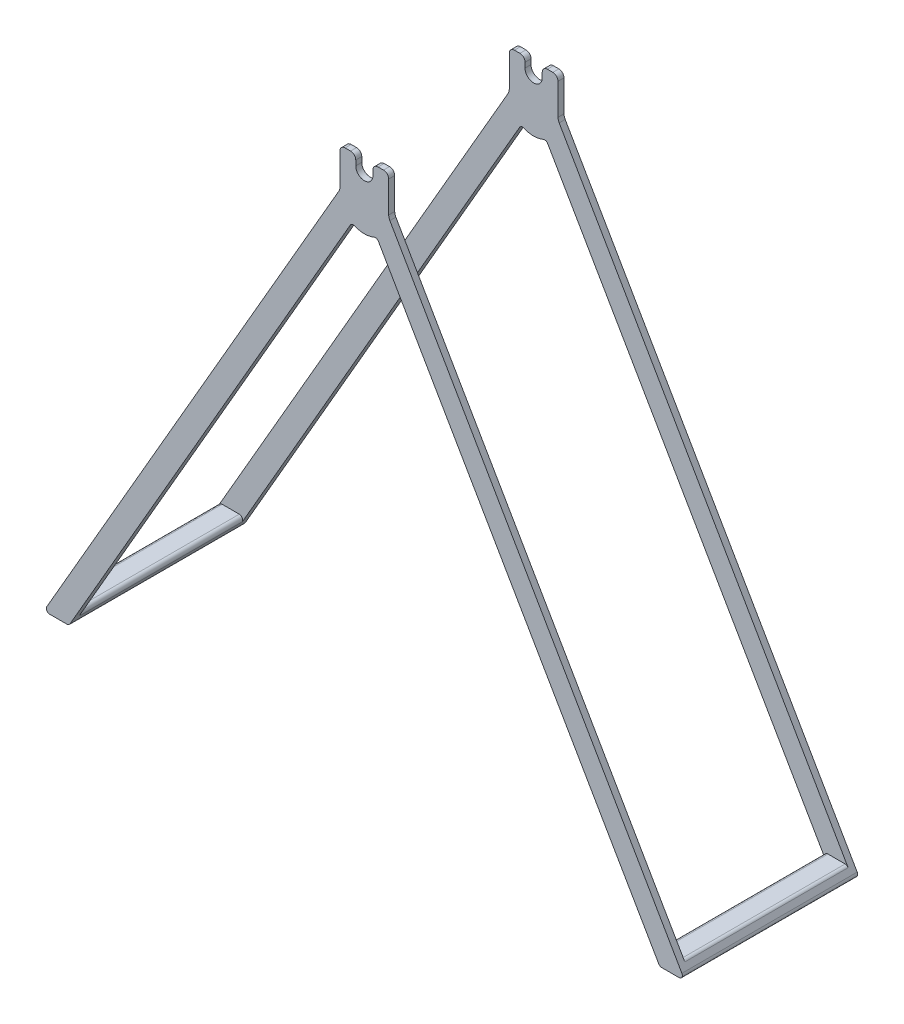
from build123d import *

# Parameters (mm, degrees)
ESTRUSIONE_ESTRUSIONE1_DEPTH = 3.5
ESTRUSIONE_ESTRUSIONE2_DEPTH = 98.5


with BuildPart() as part:
    # Schizzo1 → Estrusione-Estrusione1 (new body)
    with BuildSketch(Plane.XY):
        with BuildLine():
            Line((-183.038683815, -191.685709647), (-173.038683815, -191.685709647))
            ThreePointArc((-173.038683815, -191.685709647), (-172.038683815, -191.417760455), (-171.306633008, -190.685709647))
            Line((-171.306633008, -190.685709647), (-8.177000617, 91.863101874))
            ThreePointArc((-8.177000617, 91.863101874), (-7.079100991, 92.759902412), (-5.662598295, 92.70373386))
            ThreePointArc((-5.662598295, 92.70373386), (0, 91.550240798), (5.662598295, 92.70373386))
            ThreePointArc((5.662598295, 92.70373386), (7.079100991, 92.759902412), (8.177000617, 91.863101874))
            Line((8.177000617, 91.863101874), (171.306633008, -190.685709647))
            ThreePointArc((171.306633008, -190.685709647), (172.038683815, -191.417760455), (173.038683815, -191.685709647))
            Line((173.038683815, -191.685709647), (183.038683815, -191.685709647))
            ThreePointArc((183.038683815, -191.685709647), (184.770734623, -190.685709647), (184.770734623, -188.685709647))
            Line((184.770734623, -188.685709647), (14.846879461, 105.631040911))
            ThreePointArc((14.846879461, 105.631040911), (14.347377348, 106.836945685), (14.17700648, 108.131040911))
            Line((14.17700648, 108.131040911), (14.17700648, 126.259507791))
            ThreePointArc((14.17700648, 126.259507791), (13.298326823, 128.380828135), (11.17700648, 129.259507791))
            Line((11.17700648, 129.259507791), (8, 129.259507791))
            ThreePointArc((8, 129.259507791), (5.878679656, 128.380828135), (5, 126.259507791))
            Line((5, 126.259507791), (5, 123.314290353))
            ThreePointArc((5, 123.314290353), (0, 118.314290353), (-5, 123.314290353))
            Line((-5, 123.314290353), (-5, 126.259507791))
            ThreePointArc((-5, 126.259507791), (-5.878679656, 128.380828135), (-8, 129.259507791))
            Line((-8, 129.259507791), (-11.17700648, 129.259507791))
            ThreePointArc((-11.17700648, 129.259507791), (-13.298326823, 128.380828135), (-14.17700648, 126.259507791))
            Line((-14.17700648, 126.259507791), (-14.17700648, 108.131040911))
            ThreePointArc((-14.17700648, 108.131040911), (-14.347377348, 106.836945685), (-14.846879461, 105.631040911))
            Line((-14.846879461, 105.631040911), (-184.770734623, -188.685709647))
            ThreePointArc((-184.770734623, -188.685709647), (-184.770734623, -190.685709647), (-183.038683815, -191.685709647))
        make_face()
    extrude(amount=ESTRUSIONE_ESTRUSIONE1_DEPTH)


with BuildPart() as body_2:
    # Specchia2: mirrored copy
    add(part.part.mirror(Plane.XY.offset(51)))


with BuildPart() as part_1:
    add(part.part)

    add(body_2.part)  # Estrusione-Estrusione2 merges body 2
    # Schizzo3 → Estrusione-Estrusione2 (add)
    with BuildSketch(Plane.XY.offset(3.5)):
        with BuildLine():
            Line((182.988934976, -185.59954213), (184.770734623, -188.685709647))
            ThreePointArc((184.770734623, -188.685709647), (184.770734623, -190.685709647), (183.038683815, -191.685709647))
            Line((183.038683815, -191.685709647), (173.038683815, -191.685709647))
            ThreePointArc((173.038683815, -191.685709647), (172.038683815, -191.417760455), (171.306633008, -190.685709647))
            Line((171.306633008, -190.685709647), (169.524833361, -187.59954213))
            ThreePointArc((169.524833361, -187.59954213), (169.524833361, -185.59954213), (171.256884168, -184.59954213))
            Line((171.256884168, -184.59954213), (181.256884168, -184.59954213))
            ThreePointArc((181.256884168, -184.59954213), (182.256884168, -184.867491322), (182.988934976, -185.59954213))
        make_face()
    estrusione_estrusione2 = extrude(amount=ESTRUSIONE_ESTRUSIONE2_DEPTH)

    # Specchia3: Estrusione-Estrusione2 across plane
    add(estrusione_estrusione2.mirror(Plane.ZY))


solid = part_1.part
